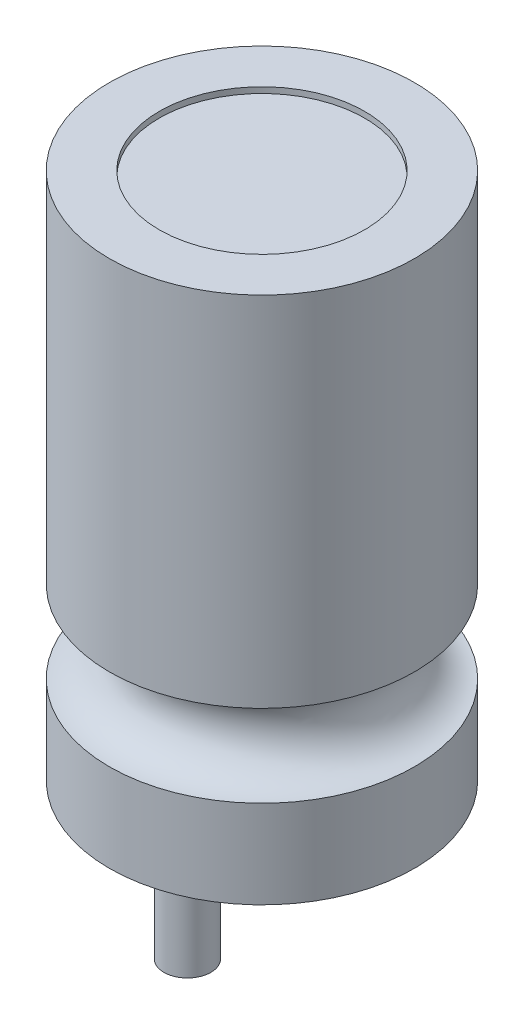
ISO-10303-21;
HEADER;
FILE_DESCRIPTION(('STEP AP214'),'2;1');
FILE_NAME('part.step','',(''),(''),'','','');
FILE_SCHEMA(('AUTOMOTIVE_DESIGN { 1 0 10303 214 1 1 1 1 }'));
ENDSEC;
DATA;
#1=APPLICATION_CONTEXT('core data for automotive mechanical design processes');
#2=APPLICATION_PROTOCOL_DEFINITION('international standard','automotive_design',2000,#1);
#3=PRODUCT_CONTEXT('',#1,'mechanical');
#4=PRODUCT('Part','Part','',(#3));
#5=PRODUCT_RELATED_PRODUCT_CATEGORY('part','',(#4));
#6=PRODUCT_DEFINITION_FORMATION('','',#4);
#7=PRODUCT_DEFINITION_CONTEXT('part definition',#1,'design');
#8=PRODUCT_DEFINITION('design','',#6,#7);
#9=PRODUCT_DEFINITION_SHAPE('','',#8);
#10=(LENGTH_UNIT() NAMED_UNIT(*) SI_UNIT(.MILLI.,.METRE.));
#11=(NAMED_UNIT(*) PLANE_ANGLE_UNIT() SI_UNIT($,.RADIAN.));
#12=(NAMED_UNIT(*) SI_UNIT($,.STERADIAN.) SOLID_ANGLE_UNIT());
#13=UNCERTAINTY_MEASURE_WITH_UNIT(LENGTH_MEASURE(1.E-05),#10,'distance_accuracy_value','');
#14=(GEOMETRIC_REPRESENTATION_CONTEXT(3) GLOBAL_UNCERTAINTY_ASSIGNED_CONTEXT((#13)) GLOBAL_UNIT_ASSIGNED_CONTEXT((#10,
#11,#12)) REPRESENTATION_CONTEXT('',''));
#15=CARTESIAN_POINT('',(0.,0.,0.));
#16=DIRECTION('',(0.,0.,1.));
#17=DIRECTION('',(1.,0.,0.));
#18=AXIS2_PLACEMENT_3D('',#15,#16,#17);
#19=CARTESIAN_POINT('',(2.6,27.5164236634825,0.));
#20=DIRECTION('',(0.,1.,0.));
#21=DIRECTION('',(0.,0.,1.));
#22=AXIS2_PLACEMENT_3D('',#19,#20,#21);
#23=PLANE('',#22);
#24=CARTESIAN_POINT('',(0.,27.5164236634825,1.27));
#25=DIRECTION('',(0.,1.,0.));
#26=DIRECTION('',(0.,0.,1.));
#27=AXIS2_PLACEMENT_3D('',#24,#25,#26);
#28=CIRCLE('',#27,0.4);
#29=CARTESIAN_POINT('',(0.,27.5164236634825,1.67));
#30=VERTEX_POINT('',#29);
#31=EDGE_CURVE('E43',#30,#30,#28,.F.);
#32=ORIENTED_EDGE('',*,*,#31,.F.);
#33=EDGE_LOOP('',(#32));
#34=FACE_BOUND('',#33,.T.);
#35=CARTESIAN_POINT('',(0.,27.5164236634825,0.));
#36=DIRECTION('',(0.,1.,0.));
#37=DIRECTION('',(0.,0.,1.));
#38=AXIS2_PLACEMENT_3D('',#35,#36,#37);
#39=CIRCLE('',#38,2.6);
#40=CARTESIAN_POINT('',(0.,27.5164236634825,2.6));
#41=VERTEX_POINT('',#40);
#42=EDGE_CURVE('E47',#41,#41,#39,.T.);
#43=ORIENTED_EDGE('',*,*,#42,.F.);
#44=EDGE_LOOP('',(#43));
#45=FACE_BOUND('',#44,.T.);
#46=CARTESIAN_POINT('',(0.,27.5164236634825,-1.27));
#47=DIRECTION('',(0.,1.,0.));
#48=DIRECTION('',(0.,0.,1.));
#49=AXIS2_PLACEMENT_3D('',#46,#47,#48);
#50=CIRCLE('',#49,0.4);
#51=CARTESIAN_POINT('',(0.,27.5164236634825,-0.869999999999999));
#52=VERTEX_POINT('',#51);
#53=EDGE_CURVE('E10',#52,#52,#50,.F.);
#54=ORIENTED_EDGE('',*,*,#53,.F.);
#55=EDGE_LOOP('',(#54));
#56=FACE_BOUND('',#55,.T.);
#57=ADVANCED_FACE('F37',(#34,#45,#56),#23,.F.);
#58=CARTESIAN_POINT('',(0.,48.4017094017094,0.));
#59=DIRECTION('',(0.,1.,0.));
#60=DIRECTION('',(0.,0.,1.));
#61=AXIS2_PLACEMENT_3D('',#58,#59,#60);
#62=CYLINDRICAL_SURFACE('',#61,2.6);
#63=CARTESIAN_POINT('',(0.,29.0164236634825,0.));
#64=DIRECTION('',(0.,1.,0.));
#65=DIRECTION('',(0.,0.,1.));
#66=AXIS2_PLACEMENT_3D('',#63,#64,#65);
#67=CIRCLE('',#66,2.6);
#68=CARTESIAN_POINT('',(0.,29.0164236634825,2.6));
#69=VERTEX_POINT('',#68);
#70=EDGE_CURVE('E51',#69,#69,#67,.T.);
#71=ORIENTED_EDGE('',*,*,#70,.F.);
#72=EDGE_LOOP('',(#71));
#73=FACE_BOUND('',#72,.T.);
#74=ORIENTED_EDGE('',*,*,#42,.T.);
#75=EDGE_LOOP('',(#74));
#76=FACE_BOUND('',#75,.T.);
#77=ADVANCED_FACE('F90',(#73,#76),#62,.T.);
#78=CARTESIAN_POINT('',(0.,29.7164236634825,0.));
#79=DIRECTION('',(0.,1.,0.));
#80=DIRECTION('',(0.,0.,1.));
#81=AXIS2_PLACEMENT_3D('',#78,#79,#80);
#82=TOROIDAL_SURFACE('',#81,2.6,0.699999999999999);
#83=CARTESIAN_POINT('',(0.,30.4164236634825,0.));
#84=DIRECTION('',(0.,1.,0.));
#85=DIRECTION('',(0.,0.,1.));
#86=AXIS2_PLACEMENT_3D('',#83,#84,#85);
#87=CIRCLE('',#86,2.6);
#88=CARTESIAN_POINT('',(0.,30.4164236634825,2.6));
#89=VERTEX_POINT('',#88);
#90=EDGE_CURVE('E56',#89,#89,#87,.T.);
#91=ORIENTED_EDGE('',*,*,#90,.F.);
#92=EDGE_LOOP('',(#91));
#93=FACE_BOUND('',#92,.T.);
#94=ORIENTED_EDGE('',*,*,#70,.T.);
#95=EDGE_LOOP('',(#94));
#96=FACE_BOUND('',#95,.T.);
#97=ADVANCED_FACE('F95',(#93,#96),#82,.F.);
#98=CARTESIAN_POINT('',(0.,48.4017094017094,0.));
#99=DIRECTION('',(0.,1.,0.));
#100=DIRECTION('',(0.,0.,1.));
#101=AXIS2_PLACEMENT_3D('',#98,#99,#100);
#102=CYLINDRICAL_SURFACE('',#101,2.6);
#103=CARTESIAN_POINT('',(0.,36.5164236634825,0.));
#104=DIRECTION('',(0.,1.,0.));
#105=DIRECTION('',(0.,0.,1.));
#106=AXIS2_PLACEMENT_3D('',#103,#104,#105);
#107=CIRCLE('',#106,2.6);
#108=CARTESIAN_POINT('',(0.,36.5164236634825,2.6));
#109=VERTEX_POINT('',#108);
#110=EDGE_CURVE('E59',#109,#109,#107,.T.);
#111=ORIENTED_EDGE('',*,*,#110,.F.);
#112=EDGE_LOOP('',(#111));
#113=FACE_BOUND('',#112,.T.);
#114=ORIENTED_EDGE('',*,*,#90,.T.);
#115=EDGE_LOOP('',(#114));
#116=FACE_BOUND('',#115,.T.);
#117=ADVANCED_FACE('F104',(#113,#116),#102,.T.);
#118=CARTESIAN_POINT('',(0.,36.5164236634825,0.));
#119=DIRECTION('',(0.,-1.,0.));
#120=DIRECTION('',(0.,0.,-1.));
#121=AXIS2_PLACEMENT_3D('',#118,#119,#120);
#122=PLANE('',#121);
#123=CARTESIAN_POINT('',(0.,36.5164236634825,0.));
#124=DIRECTION('',(0.,1.,0.));
#125=DIRECTION('',(0.,0.,1.));
#126=AXIS2_PLACEMENT_3D('',#123,#124,#125);
#127=CIRCLE('',#126,1.75);
#128=CARTESIAN_POINT('',(0.,36.5164236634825,1.75));
#129=VERTEX_POINT('',#128);
#130=EDGE_CURVE('E63',#129,#129,#127,.T.);
#131=ORIENTED_EDGE('',*,*,#130,.F.);
#132=EDGE_LOOP('',(#131));
#133=FACE_BOUND('',#132,.T.);
#134=ORIENTED_EDGE('',*,*,#110,.T.);
#135=EDGE_LOOP('',(#134));
#136=FACE_BOUND('',#135,.T.);
#137=ADVANCED_FACE('F111',(#133,#136),#122,.F.);
#138=CARTESIAN_POINT('',(0.,36.4164236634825,0.));
#139=DIRECTION('',(0.,1.,0.));
#140=DIRECTION('',(0.,0.,1.));
#141=AXIS2_PLACEMENT_3D('',#138,#139,#140);
#142=CYLINDRICAL_SURFACE('',#141,1.75);
#143=CARTESIAN_POINT('',(0.,36.4164236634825,0.));
#144=DIRECTION('',(0.,1.,0.));
#145=DIRECTION('',(0.,0.,1.));
#146=AXIS2_PLACEMENT_3D('',#143,#144,#145);
#147=CIRCLE('',#146,1.75);
#148=CARTESIAN_POINT('',(0.,36.4164236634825,1.75));
#149=VERTEX_POINT('',#148);
#150=EDGE_CURVE('E62',#149,#149,#147,.T.);
#151=ORIENTED_EDGE('',*,*,#150,.F.);
#152=EDGE_LOOP('',(#151));
#153=FACE_BOUND('',#152,.T.);
#154=ORIENTED_EDGE('',*,*,#130,.T.);
#155=EDGE_LOOP('',(#154));
#156=FACE_BOUND('',#155,.T.);
#157=ADVANCED_FACE('F115',(#153,#156),#142,.F.);
#158=CARTESIAN_POINT('',(0.,36.4164236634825,0.));
#159=DIRECTION('',(0.,1.,0.));
#160=DIRECTION('',(0.,0.,1.));
#161=AXIS2_PLACEMENT_3D('',#158,#159,#160);
#162=PLANE('',#161);
#163=ORIENTED_EDGE('',*,*,#150,.T.);
#164=EDGE_LOOP('',(#163));
#165=FACE_BOUND('',#164,.T.);
#166=ADVANCED_FACE('F119',(#165),#162,.T.);
#167=CARTESIAN_POINT('',(0.,25.5164236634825,1.27));
#168=DIRECTION('',(0.,1.,0.));
#169=DIRECTION('',(0.,0.,1.));
#170=AXIS2_PLACEMENT_3D('',#167,#168,#169);
#171=CYLINDRICAL_SURFACE('',#170,0.4);
#172=CARTESIAN_POINT('',(0.,25.5164236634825,1.27));
#173=DIRECTION('',(0.,-1.,0.));
#174=DIRECTION('',(0.,0.,-1.));
#175=AXIS2_PLACEMENT_3D('',#172,#173,#174);
#176=CIRCLE('',#175,0.4);
#177=CARTESIAN_POINT('',(0.,25.5164236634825,0.869999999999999));
#178=VERTEX_POINT('',#177);
#179=EDGE_CURVE('E66',#178,#178,#176,.T.);
#180=ORIENTED_EDGE('',*,*,#179,.F.);
#181=EDGE_LOOP('',(#180));
#182=FACE_BOUND('',#181,.T.);
#183=ORIENTED_EDGE('',*,*,#31,.T.);
#184=EDGE_LOOP('',(#183));
#185=FACE_BOUND('',#184,.T.);
#186=ADVANCED_FACE('F86',(#182,#185),#171,.T.);
#187=CARTESIAN_POINT('',(0.,25.5164236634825,1.27));
#188=DIRECTION('',(0.,-1.,0.));
#189=DIRECTION('',(0.,0.,-1.));
#190=AXIS2_PLACEMENT_3D('',#187,#188,#189);
#191=PLANE('',#190);
#192=ORIENTED_EDGE('',*,*,#179,.T.);
#193=EDGE_LOOP('',(#192));
#194=FACE_BOUND('',#193,.T.);
#195=ADVANCED_FACE('F79',(#194),#191,.T.);
#196=CARTESIAN_POINT('',(0.,25.5164236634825,-1.27));
#197=DIRECTION('',(0.,1.,0.));
#198=DIRECTION('',(0.,0.,1.));
#199=AXIS2_PLACEMENT_3D('',#196,#197,#198);
#200=CYLINDRICAL_SURFACE('',#199,0.4);
#201=CARTESIAN_POINT('',(0.,25.5164236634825,-1.27));
#202=DIRECTION('',(0.,-1.,0.));
#203=DIRECTION('',(0.,0.,1.));
#204=AXIS2_PLACEMENT_3D('',#201,#202,#203);
#205=CIRCLE('',#204,0.4);
#206=CARTESIAN_POINT('',(0.,25.5164236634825,-0.869999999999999));
#207=VERTEX_POINT('',#206);
#208=EDGE_CURVE('E71',#207,#207,#205,.T.);
#209=ORIENTED_EDGE('',*,*,#208,.F.);
#210=EDGE_LOOP('',(#209));
#211=FACE_BOUND('',#210,.T.);
#212=ORIENTED_EDGE('',*,*,#53,.T.);
#213=EDGE_LOOP('',(#212));
#214=FACE_BOUND('',#213,.T.);
#215=ADVANCED_FACE('F77',(#211,#214),#200,.T.);
#216=CARTESIAN_POINT('',(0.,25.5164236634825,-1.27));
#217=DIRECTION('',(0.,1.,0.));
#218=DIRECTION('',(0.,0.,1.));
#219=AXIS2_PLACEMENT_3D('',#216,#217,#218);
#220=PLANE('',#219);
#221=ORIENTED_EDGE('',*,*,#208,.T.);
#222=EDGE_LOOP('',(#221));
#223=FACE_BOUND('',#222,.T.);
#224=ADVANCED_FACE('F75',(#223),#220,.F.);
#225=CLOSED_SHELL('',(#57,#77,#97,#117,#137,#157,#166,#186,#195,#215,#224));
#226=MANIFOLD_SOLID_BREP('B2',#225);
#227=ADVANCED_BREP_SHAPE_REPRESENTATION('',(#18,#226),#14);
#228=SHAPE_DEFINITION_REPRESENTATION(#9,#227);
ENDSEC;
END-ISO-10303-21;
